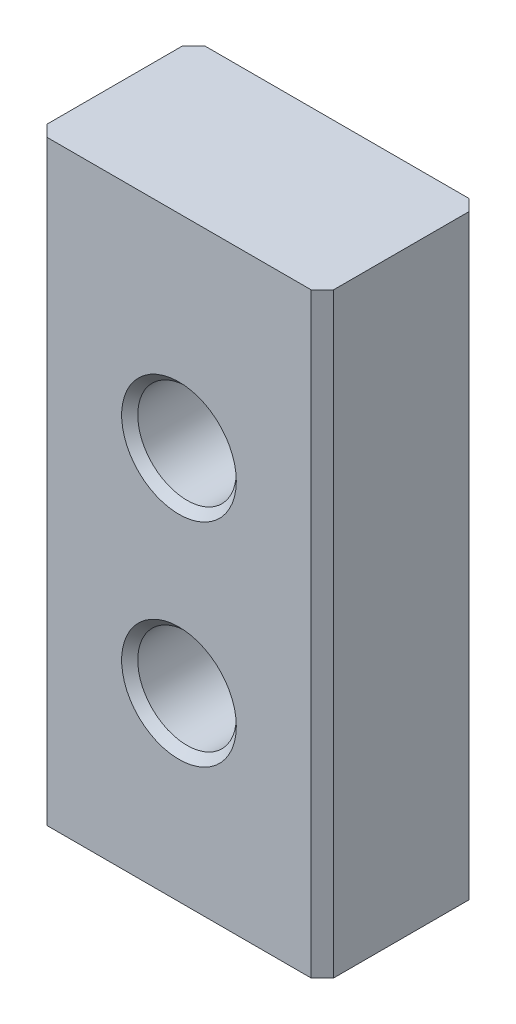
ISO-10303-21;
HEADER;
FILE_DESCRIPTION(('STEP AP214'),'2;1');
FILE_NAME('part.step','',(''),(''),'','','');
FILE_SCHEMA(('AUTOMOTIVE_DESIGN { 1 0 10303 214 1 1 1 1 }'));
ENDSEC;
DATA;
#1=APPLICATION_CONTEXT('core data for automotive mechanical design processes');
#2=APPLICATION_PROTOCOL_DEFINITION('international standard','automotive_design',2000,#1);
#3=PRODUCT_CONTEXT('',#1,'mechanical');
#4=PRODUCT('Part','Part','',(#3));
#5=PRODUCT_RELATED_PRODUCT_CATEGORY('part','',(#4));
#6=PRODUCT_DEFINITION_FORMATION('','',#4);
#7=PRODUCT_DEFINITION_CONTEXT('part definition',#1,'design');
#8=PRODUCT_DEFINITION('design','',#6,#7);
#9=PRODUCT_DEFINITION_SHAPE('','',#8);
#10=(LENGTH_UNIT() NAMED_UNIT(*) SI_UNIT(.MILLI.,.METRE.));
#11=(NAMED_UNIT(*) PLANE_ANGLE_UNIT() SI_UNIT($,.RADIAN.));
#12=(NAMED_UNIT(*) SI_UNIT($,.STERADIAN.) SOLID_ANGLE_UNIT());
#13=UNCERTAINTY_MEASURE_WITH_UNIT(LENGTH_MEASURE(1.E-05),#10,'distance_accuracy_value','');
#14=(GEOMETRIC_REPRESENTATION_CONTEXT(3) GLOBAL_UNCERTAINTY_ASSIGNED_CONTEXT((#13)) GLOBAL_UNIT_ASSIGNED_CONTEXT((#10,
#11,#12)) REPRESENTATION_CONTEXT('',''));
#15=CARTESIAN_POINT('',(0.,0.,0.));
#16=DIRECTION('',(0.,0.,1.));
#17=DIRECTION('',(1.,0.,0.));
#18=AXIS2_PLACEMENT_3D('',#15,#16,#17);
#19=CARTESIAN_POINT('',(-6.35,26.4,7.));
#20=DIRECTION('',(1.,0.,0.));
#21=DIRECTION('',(0.,1.,0.));
#22=AXIS2_PLACEMENT_3D('',#19,#20,#21);
#23=PLANE('',#22);
#24=DIRECTION('',(0.,0.,-1.));
#25=VECTOR('',#24,1.);
#26=CARTESIAN_POINT('',(-6.35,26.4,7.));
#27=LINE('',#26,#25);
#28=CARTESIAN_POINT('',(-6.35,26.4,6.5));
#29=VERTEX_POINT('',#28);
#30=CARTESIAN_POINT('',(-6.35,26.4,0.500000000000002));
#31=VERTEX_POINT('',#30);
#32=EDGE_CURVE('E119',#29,#31,#27,.T.);
#33=ORIENTED_EDGE('',*,*,#32,.T.);
#34=DIRECTION('',(0.,-1.,0.));
#35=VECTOR('',#34,1.);
#36=CARTESIAN_POINT('',(-6.35,26.4,0.5));
#37=LINE('',#36,#35);
#38=CARTESIAN_POINT('',(-6.35,0.,0.500000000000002));
#39=VERTEX_POINT('',#38);
#40=EDGE_CURVE('E145',#31,#39,#37,.T.);
#41=ORIENTED_EDGE('',*,*,#40,.T.);
#42=DIRECTION('',(0.,0.,-1.));
#43=VECTOR('',#42,1.);
#44=CARTESIAN_POINT('',(-6.35,0.,7.));
#45=LINE('',#44,#43);
#46=CARTESIAN_POINT('',(-6.35,0.,6.5));
#47=VERTEX_POINT('',#46);
#48=EDGE_CURVE('E124',#47,#39,#45,.T.);
#49=ORIENTED_EDGE('',*,*,#48,.F.);
#50=DIRECTION('',(0.,1.,0.));
#51=VECTOR('',#50,1.);
#52=CARTESIAN_POINT('',(-6.35,26.4,6.5));
#53=LINE('',#52,#51);
#54=EDGE_CURVE('E143',#47,#29,#53,.T.);
#55=ORIENTED_EDGE('',*,*,#54,.T.);
#56=EDGE_LOOP('',(#33,#41,#49,#55));
#57=FACE_BOUND('',#56,.T.);
#58=ADVANCED_FACE('F31',(#57),#23,.F.);
#59=CARTESIAN_POINT('',(-6.35,0.,7.));
#60=DIRECTION('',(0.,1.,0.));
#61=DIRECTION('',(0.,0.,1.));
#62=AXIS2_PLACEMENT_3D('',#59,#60,#61);
#63=PLANE('',#62);
#64=DIRECTION('',(1.,0.,0.));
#65=VECTOR('',#64,1.);
#66=CARTESIAN_POINT('',(-6.35,0.,0.));
#67=LINE('',#66,#65);
#68=CARTESIAN_POINT('',(-5.85,0.,0.));
#69=VERTEX_POINT('',#68);
#70=CARTESIAN_POINT('',(5.84999999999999,0.,0.));
#71=VERTEX_POINT('',#70);
#72=EDGE_CURVE('E160',#69,#71,#67,.T.);
#73=ORIENTED_EDGE('',*,*,#72,.T.);
#74=DIRECTION('',(-0.70710678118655,0.,-0.707106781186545));
#75=VECTOR('',#74,1.);
#76=CARTESIAN_POINT('',(6.35,0.,0.500000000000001));
#77=LINE('',#76,#75);
#78=CARTESIAN_POINT('',(6.35,0.,0.500000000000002));
#79=VERTEX_POINT('',#78);
#80=EDGE_CURVE('E141',#71,#79,#77,.F.);
#81=ORIENTED_EDGE('',*,*,#80,.T.);
#82=DIRECTION('',(0.,0.,-1.));
#83=VECTOR('',#82,1.);
#84=CARTESIAN_POINT('',(6.35,0.,7.));
#85=LINE('',#84,#83);
#86=CARTESIAN_POINT('',(6.35,0.,6.5));
#87=VERTEX_POINT('',#86);
#88=EDGE_CURVE('E118',#87,#79,#85,.T.);
#89=ORIENTED_EDGE('',*,*,#88,.F.);
#90=DIRECTION('',(-0.707106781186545,0.,0.70710678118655));
#91=VECTOR('',#90,1.);
#92=CARTESIAN_POINT('',(5.85,0.,7.));
#93=LINE('',#92,#91);
#94=CARTESIAN_POINT('',(5.85,0.,7.));
#95=VERTEX_POINT('',#94);
#96=EDGE_CURVE('E123',#87,#95,#93,.T.);
#97=ORIENTED_EDGE('',*,*,#96,.T.);
#98=DIRECTION('',(1.,0.,0.));
#99=VECTOR('',#98,1.);
#100=CARTESIAN_POINT('',(-6.35,0.,7.));
#101=LINE('',#100,#99);
#102=CARTESIAN_POINT('',(-5.85,0.,7.));
#103=VERTEX_POINT('',#102);
#104=EDGE_CURVE('E151',#103,#95,#101,.T.);
#105=ORIENTED_EDGE('',*,*,#104,.F.);
#106=DIRECTION('',(-0.707106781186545,0.,-0.70710678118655));
#107=VECTOR('',#106,1.);
#108=CARTESIAN_POINT('',(-5.85,0.,7.));
#109=LINE('',#108,#107);
#110=EDGE_CURVE('E54',#103,#47,#109,.T.);
#111=ORIENTED_EDGE('',*,*,#110,.T.);
#112=ORIENTED_EDGE('',*,*,#48,.T.);
#113=DIRECTION('',(-0.70710678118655,0.,0.707106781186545));
#114=VECTOR('',#113,1.);
#115=CARTESIAN_POINT('',(-6.35,0.,0.500000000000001));
#116=LINE('',#115,#114);
#117=EDGE_CURVE('E46',#39,#69,#116,.F.);
#118=ORIENTED_EDGE('',*,*,#117,.T.);
#119=EDGE_LOOP('',(#73,#81,#89,#97,#105,#111,#112,#118));
#120=FACE_BOUND('',#119,.T.);
#121=ADVANCED_FACE('F155',(#120),#63,.F.);
#122=CARTESIAN_POINT('',(6.35,26.4,7.));
#123=DIRECTION('',(-1.,0.,0.));
#124=DIRECTION('',(0.,-1.,0.));
#125=AXIS2_PLACEMENT_3D('',#122,#123,#124);
#126=PLANE('',#125);
#127=ORIENTED_EDGE('',*,*,#88,.T.);
#128=DIRECTION('',(0.,1.,0.));
#129=VECTOR('',#128,1.);
#130=CARTESIAN_POINT('',(6.35,26.4,0.5));
#131=LINE('',#130,#129);
#132=CARTESIAN_POINT('',(6.35,26.4,0.500000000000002));
#133=VERTEX_POINT('',#132);
#134=EDGE_CURVE('E117',#79,#133,#131,.T.);
#135=ORIENTED_EDGE('',*,*,#134,.T.);
#136=DIRECTION('',(0.,0.,-1.));
#137=VECTOR('',#136,1.);
#138=CARTESIAN_POINT('',(6.35,26.4,7.));
#139=LINE('',#138,#137);
#140=CARTESIAN_POINT('',(6.35,26.4,6.5));
#141=VERTEX_POINT('',#140);
#142=EDGE_CURVE('E101',#141,#133,#139,.T.);
#143=ORIENTED_EDGE('',*,*,#142,.F.);
#144=DIRECTION('',(0.,-1.,0.));
#145=VECTOR('',#144,1.);
#146=CARTESIAN_POINT('',(6.35,0.,6.5));
#147=LINE('',#146,#145);
#148=EDGE_CURVE('E114',#141,#87,#147,.T.);
#149=ORIENTED_EDGE('',*,*,#148,.T.);
#150=EDGE_LOOP('',(#127,#135,#143,#149));
#151=FACE_BOUND('',#150,.T.);
#152=ADVANCED_FACE('F113',(#151),#126,.F.);
#153=CARTESIAN_POINT('',(-6.35,26.4,7.));
#154=DIRECTION('',(0.,-1.,0.));
#155=DIRECTION('',(0.,0.,-1.));
#156=AXIS2_PLACEMENT_3D('',#153,#154,#155);
#157=PLANE('',#156);
#158=ORIENTED_EDGE('',*,*,#142,.T.);
#159=DIRECTION('',(0.70710678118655,0.,0.707106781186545));
#160=VECTOR('',#159,1.);
#161=CARTESIAN_POINT('',(6.35,26.4,0.5));
#162=LINE('',#161,#160);
#163=CARTESIAN_POINT('',(5.85,26.4,0.));
#164=VERTEX_POINT('',#163);
#165=EDGE_CURVE('E132',#133,#164,#162,.F.);
#166=ORIENTED_EDGE('',*,*,#165,.T.);
#167=DIRECTION('',(-1.,0.,0.));
#168=VECTOR('',#167,1.);
#169=CARTESIAN_POINT('',(-6.35,26.4,0.));
#170=LINE('',#169,#168);
#171=CARTESIAN_POINT('',(-5.85,26.4,0.));
#172=VERTEX_POINT('',#171);
#173=EDGE_CURVE('E156',#164,#172,#170,.T.);
#174=ORIENTED_EDGE('',*,*,#173,.T.);
#175=DIRECTION('',(0.70710678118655,0.,-0.707106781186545));
#176=VECTOR('',#175,1.);
#177=CARTESIAN_POINT('',(-6.35,26.4,0.5));
#178=LINE('',#177,#176);
#179=EDGE_CURVE('E107',#172,#31,#178,.F.);
#180=ORIENTED_EDGE('',*,*,#179,.T.);
#181=ORIENTED_EDGE('',*,*,#32,.F.);
#182=DIRECTION('',(0.707106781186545,0.,0.70710678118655));
#183=VECTOR('',#182,1.);
#184=CARTESIAN_POINT('',(-5.85,26.4,7.));
#185=LINE('',#184,#183);
#186=CARTESIAN_POINT('',(-5.85,26.4,7.));
#187=VERTEX_POINT('',#186);
#188=EDGE_CURVE('E108',#29,#187,#185,.T.);
#189=ORIENTED_EDGE('',*,*,#188,.T.);
#190=DIRECTION('',(-1.,0.,0.));
#191=VECTOR('',#190,1.);
#192=CARTESIAN_POINT('',(-6.35,26.4,7.));
#193=LINE('',#192,#191);
#194=CARTESIAN_POINT('',(5.85,26.4,7.));
#195=VERTEX_POINT('',#194);
#196=EDGE_CURVE('E103',#195,#187,#193,.T.);
#197=ORIENTED_EDGE('',*,*,#196,.F.);
#198=DIRECTION('',(0.707106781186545,0.,-0.70710678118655));
#199=VECTOR('',#198,1.);
#200=CARTESIAN_POINT('',(5.85,26.4,7.));
#201=LINE('',#200,#199);
#202=EDGE_CURVE('E98',#195,#141,#201,.T.);
#203=ORIENTED_EDGE('',*,*,#202,.T.);
#204=EDGE_LOOP('',(#158,#166,#174,#180,#181,#189,#197,#203));
#205=FACE_BOUND('',#204,.T.);
#206=ADVANCED_FACE('F100',(#205),#157,.F.);
#207=CARTESIAN_POINT('',(-6.35,0.,7.));
#208=DIRECTION('',(0.,0.,1.));
#209=DIRECTION('',(1.,0.,0.));
#210=AXIS2_PLACEMENT_3D('',#207,#208,#209);
#211=PLANE('',#210);
#212=CARTESIAN_POINT('',(0.,8.,7.));
#213=DIRECTION('',(0.,0.,1.));
#214=DIRECTION('',(1.,0.,0.));
#215=AXIS2_PLACEMENT_3D('',#212,#213,#214);
#216=CIRCLE('',#215,2.54);
#217=CARTESIAN_POINT('',(2.54,8.,7.));
#218=VERTEX_POINT('',#217);
#219=EDGE_CURVE('E324',#218,#218,#216,.T.);
#220=ORIENTED_EDGE('',*,*,#219,.F.);
#221=EDGE_LOOP('',(#220));
#222=FACE_BOUND('',#221,.T.);
#223=CARTESIAN_POINT('',(0.,17.4,7.));
#224=DIRECTION('',(0.,0.,1.));
#225=DIRECTION('',(1.,0.,0.));
#226=AXIS2_PLACEMENT_3D('',#223,#224,#225);
#227=CIRCLE('',#226,2.54);
#228=CARTESIAN_POINT('',(2.54,17.4,7.));
#229=VERTEX_POINT('',#228);
#230=EDGE_CURVE('E327',#229,#229,#227,.T.);
#231=ORIENTED_EDGE('',*,*,#230,.F.);
#232=EDGE_LOOP('',(#231));
#233=FACE_BOUND('',#232,.T.);
#234=ORIENTED_EDGE('',*,*,#104,.T.);
#235=DIRECTION('',(0.,1.,0.));
#236=VECTOR('',#235,1.);
#237=CARTESIAN_POINT('',(5.85,26.4,7.));
#238=LINE('',#237,#236);
#239=EDGE_CURVE('E11',#95,#195,#238,.T.);
#240=ORIENTED_EDGE('',*,*,#239,.T.);
#241=ORIENTED_EDGE('',*,*,#196,.T.);
#242=DIRECTION('',(0.,-1.,0.));
#243=VECTOR('',#242,1.);
#244=CARTESIAN_POINT('',(-5.85,0.,7.));
#245=LINE('',#244,#243);
#246=EDGE_CURVE('E39',#187,#103,#245,.T.);
#247=ORIENTED_EDGE('',*,*,#246,.T.);
#248=EDGE_LOOP('',(#234,#240,#241,#247));
#249=FACE_BOUND('',#248,.T.);
#250=ADVANCED_FACE('F150',(#222,#233,#249),#211,.T.);
#251=CARTESIAN_POINT('',(-6.35,0.,0.));
#252=DIRECTION('',(0.,0.,1.));
#253=DIRECTION('',(1.,0.,0.));
#254=AXIS2_PLACEMENT_3D('',#251,#252,#253);
#255=PLANE('',#254);
#256=CARTESIAN_POINT('',(0.,8.,0.));
#257=DIRECTION('',(0.,0.,1.));
#258=DIRECTION('',(1.,0.,0.));
#259=AXIS2_PLACEMENT_3D('',#256,#257,#258);
#260=CIRCLE('',#259,2.54);
#261=CARTESIAN_POINT('',(2.54,8.,0.));
#262=VERTEX_POINT('',#261);
#263=EDGE_CURVE('E330',#262,#262,#260,.T.);
#264=ORIENTED_EDGE('',*,*,#263,.T.);
#265=EDGE_LOOP('',(#264));
#266=FACE_BOUND('',#265,.T.);
#267=CARTESIAN_POINT('',(0.,17.4,0.));
#268=DIRECTION('',(0.,0.,1.));
#269=DIRECTION('',(1.,0.,0.));
#270=AXIS2_PLACEMENT_3D('',#267,#268,#269);
#271=CIRCLE('',#270,2.54);
#272=CARTESIAN_POINT('',(2.54,17.4,0.));
#273=VERTEX_POINT('',#272);
#274=EDGE_CURVE('E163',#273,#273,#271,.T.);
#275=ORIENTED_EDGE('',*,*,#274,.T.);
#276=EDGE_LOOP('',(#275));
#277=FACE_BOUND('',#276,.T.);
#278=ORIENTED_EDGE('',*,*,#173,.F.);
#279=DIRECTION('',(0.,-1.,0.));
#280=VECTOR('',#279,1.);
#281=CARTESIAN_POINT('',(5.85,0.,0.));
#282=LINE('',#281,#280);
#283=EDGE_CURVE('E136',#164,#71,#282,.T.);
#284=ORIENTED_EDGE('',*,*,#283,.T.);
#285=ORIENTED_EDGE('',*,*,#72,.F.);
#286=DIRECTION('',(0.,1.,0.));
#287=VECTOR('',#286,1.);
#288=CARTESIAN_POINT('',(-5.85,0.,0.));
#289=LINE('',#288,#287);
#290=EDGE_CURVE('E134',#69,#172,#289,.T.);
#291=ORIENTED_EDGE('',*,*,#290,.T.);
#292=EDGE_LOOP('',(#278,#284,#285,#291));
#293=FACE_BOUND('',#292,.T.);
#294=ADVANCED_FACE('F175',(#266,#277,#293),#255,.F.);
#295=CARTESIAN_POINT('',(0.,17.4,0.357124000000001));
#296=DIRECTION('',(0.,0.,-1.));
#297=DIRECTION('',(-1.,0.,0.));
#298=AXIS2_PLACEMENT_3D('',#295,#296,#297);
#299=CONICAL_SURFACE('',#298,2.182876,0.785398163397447);
#300=ORIENTED_EDGE('',*,*,#274,.F.);
#301=EDGE_LOOP('',(#300));
#302=FACE_BOUND('',#301,.T.);
#303=CARTESIAN_POINT('',(0.,17.4,0.357124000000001));
#304=DIRECTION('',(0.,0.,1.));
#305=DIRECTION('',(1.,0.,0.));
#306=AXIS2_PLACEMENT_3D('',#303,#304,#305);
#307=CIRCLE('',#306,2.182876);
#308=CARTESIAN_POINT('',(2.182876,17.4,0.357124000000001));
#309=VERTEX_POINT('',#308);
#310=EDGE_CURVE('E333',#309,#309,#307,.T.);
#311=ORIENTED_EDGE('',*,*,#310,.T.);
#312=EDGE_LOOP('',(#311));
#313=FACE_BOUND('',#312,.T.);
#314=ADVANCED_FACE('F262',(#302,#313),#299,.F.);
#315=CARTESIAN_POINT('',(0.,17.4,7.));
#316=DIRECTION('',(0.,0.,1.));
#317=DIRECTION('',(1.,0.,0.));
#318=AXIS2_PLACEMENT_3D('',#315,#316,#317);
#319=CYLINDRICAL_SURFACE('',#318,2.182876);
#320=ORIENTED_EDGE('',*,*,#310,.F.);
#321=EDGE_LOOP('',(#320));
#322=FACE_BOUND('',#321,.T.);
#323=CARTESIAN_POINT('',(0.,17.4,6.642876));
#324=DIRECTION('',(0.,0.,1.));
#325=DIRECTION('',(1.,0.,0.));
#326=AXIS2_PLACEMENT_3D('',#323,#324,#325);
#327=CIRCLE('',#326,2.182876);
#328=CARTESIAN_POINT('',(2.182876,17.4,6.642876));
#329=VERTEX_POINT('',#328);
#330=EDGE_CURVE('E329',#329,#329,#327,.T.);
#331=ORIENTED_EDGE('',*,*,#330,.T.);
#332=EDGE_LOOP('',(#331));
#333=FACE_BOUND('',#332,.T.);
#334=ADVANCED_FACE('F253',(#322,#333),#319,.F.);
#335=CARTESIAN_POINT('',(0.,17.4,7.));
#336=DIRECTION('',(0.,0.,1.));
#337=DIRECTION('',(1.,0.,0.));
#338=AXIS2_PLACEMENT_3D('',#335,#336,#337);
#339=CONICAL_SURFACE('',#338,2.54,0.78539816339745);
#340=ORIENTED_EDGE('',*,*,#330,.F.);
#341=EDGE_LOOP('',(#340));
#342=FACE_BOUND('',#341,.T.);
#343=ORIENTED_EDGE('',*,*,#230,.T.);
#344=EDGE_LOOP('',(#343));
#345=FACE_BOUND('',#344,.T.);
#346=ADVANCED_FACE('F244',(#342,#345),#339,.F.);
#347=CARTESIAN_POINT('',(0.,8.,0.357124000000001));
#348=DIRECTION('',(0.,0.,-1.));
#349=DIRECTION('',(-1.,0.,0.));
#350=AXIS2_PLACEMENT_3D('',#347,#348,#349);
#351=CONICAL_SURFACE('',#350,2.182876,0.785398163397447);
#352=ORIENTED_EDGE('',*,*,#263,.F.);
#353=EDGE_LOOP('',(#352));
#354=FACE_BOUND('',#353,.T.);
#355=CARTESIAN_POINT('',(0.,8.,0.357124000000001));
#356=DIRECTION('',(0.,0.,1.));
#357=DIRECTION('',(1.,0.,0.));
#358=AXIS2_PLACEMENT_3D('',#355,#356,#357);
#359=CIRCLE('',#358,2.182876);
#360=CARTESIAN_POINT('',(2.182876,8.,0.357124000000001));
#361=VERTEX_POINT('',#360);
#362=EDGE_CURVE('E336',#361,#361,#359,.T.);
#363=ORIENTED_EDGE('',*,*,#362,.T.);
#364=EDGE_LOOP('',(#363));
#365=FACE_BOUND('',#364,.T.);
#366=ADVANCED_FACE('F235',(#354,#365),#351,.F.);
#367=CARTESIAN_POINT('',(0.,8.,7.));
#368=DIRECTION('',(0.,0.,1.));
#369=DIRECTION('',(1.,0.,0.));
#370=AXIS2_PLACEMENT_3D('',#367,#368,#369);
#371=CYLINDRICAL_SURFACE('',#370,2.182876);
#372=ORIENTED_EDGE('',*,*,#362,.F.);
#373=EDGE_LOOP('',(#372));
#374=FACE_BOUND('',#373,.T.);
#375=CARTESIAN_POINT('',(0.,8.,6.642876));
#376=DIRECTION('',(0.,0.,1.));
#377=DIRECTION('',(1.,0.,0.));
#378=AXIS2_PLACEMENT_3D('',#375,#376,#377);
#379=CIRCLE('',#378,2.182876);
#380=CARTESIAN_POINT('',(2.182876,8.,6.642876));
#381=VERTEX_POINT('',#380);
#382=EDGE_CURVE('E349',#381,#381,#379,.T.);
#383=ORIENTED_EDGE('',*,*,#382,.T.);
#384=EDGE_LOOP('',(#383));
#385=FACE_BOUND('',#384,.T.);
#386=ADVANCED_FACE('F226',(#374,#385),#371,.F.);
#387=CARTESIAN_POINT('',(0.,8.,7.));
#388=DIRECTION('',(0.,0.,1.));
#389=DIRECTION('',(1.,0.,0.));
#390=AXIS2_PLACEMENT_3D('',#387,#388,#389);
#391=CONICAL_SURFACE('',#390,2.54,0.78539816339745);
#392=ORIENTED_EDGE('',*,*,#382,.F.);
#393=EDGE_LOOP('',(#392));
#394=FACE_BOUND('',#393,.T.);
#395=ORIENTED_EDGE('',*,*,#219,.T.);
#396=EDGE_LOOP('',(#395));
#397=FACE_BOUND('',#396,.T.);
#398=ADVANCED_FACE('F195',(#394,#397),#391,.F.);
#399=CARTESIAN_POINT('',(6.35,26.4,0.5));
#400=DIRECTION('',(-0.707106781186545,0.,0.70710678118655));
#401=DIRECTION('',(0.70710678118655,0.,0.707106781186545));
#402=AXIS2_PLACEMENT_3D('',#399,#400,#401);
#403=PLANE('',#402);
#404=ORIENTED_EDGE('',*,*,#80,.F.);
#405=ORIENTED_EDGE('',*,*,#283,.F.);
#406=ORIENTED_EDGE('',*,*,#165,.F.);
#407=ORIENTED_EDGE('',*,*,#134,.F.);
#408=EDGE_LOOP('',(#404,#405,#406,#407));
#409=FACE_BOUND('',#408,.T.);
#410=ADVANCED_FACE('F170',(#409),#403,.F.);
#411=CARTESIAN_POINT('',(-6.35,26.4,0.5));
#412=DIRECTION('',(0.707106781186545,0.,0.70710678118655));
#413=DIRECTION('',(0.70710678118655,0.,-0.707106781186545));
#414=AXIS2_PLACEMENT_3D('',#411,#412,#413);
#415=PLANE('',#414);
#416=ORIENTED_EDGE('',*,*,#179,.F.);
#417=ORIENTED_EDGE('',*,*,#290,.F.);
#418=ORIENTED_EDGE('',*,*,#117,.F.);
#419=ORIENTED_EDGE('',*,*,#40,.F.);
#420=EDGE_LOOP('',(#416,#417,#418,#419));
#421=FACE_BOUND('',#420,.T.);
#422=ADVANCED_FACE('F177',(#421),#415,.F.);
#423=CARTESIAN_POINT('',(5.85,0.,7.));
#424=DIRECTION('',(0.70710678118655,0.,0.707106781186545));
#425=DIRECTION('',(0.707106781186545,0.,-0.70710678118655));
#426=AXIS2_PLACEMENT_3D('',#423,#424,#425);
#427=PLANE('',#426);
#428=ORIENTED_EDGE('',*,*,#96,.F.);
#429=ORIENTED_EDGE('',*,*,#148,.F.);
#430=ORIENTED_EDGE('',*,*,#202,.F.);
#431=ORIENTED_EDGE('',*,*,#239,.F.);
#432=EDGE_LOOP('',(#428,#429,#430,#431));
#433=FACE_BOUND('',#432,.T.);
#434=ADVANCED_FACE('F122',(#433),#427,.T.);
#435=CARTESIAN_POINT('',(-5.85,0.,7.));
#436=DIRECTION('',(-0.70710678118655,0.,0.707106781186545));
#437=DIRECTION('',(0.707106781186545,0.,0.70710678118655));
#438=AXIS2_PLACEMENT_3D('',#435,#436,#437);
#439=PLANE('',#438);
#440=ORIENTED_EDGE('',*,*,#188,.F.);
#441=ORIENTED_EDGE('',*,*,#54,.F.);
#442=ORIENTED_EDGE('',*,*,#110,.F.);
#443=ORIENTED_EDGE('',*,*,#246,.F.);
#444=EDGE_LOOP('',(#440,#441,#442,#443));
#445=FACE_BOUND('',#444,.T.);
#446=ADVANCED_FACE('F33',(#445),#439,.T.);
#447=CLOSED_SHELL('',(#58,#121,#152,#206,#250,#294,#314,#334,#346,#366,#386,#398,#410,#422,#434,#446));
#448=MANIFOLD_SOLID_BREP('B2',#447);
#449=ADVANCED_BREP_SHAPE_REPRESENTATION('',(#18,#448),#14);
#450=SHAPE_DEFINITION_REPRESENTATION(#9,#449);
ENDSEC;
END-ISO-10303-21;
